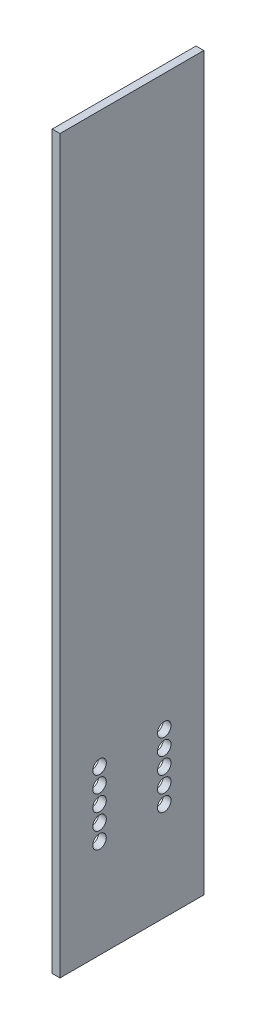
ISO-10303-21;
HEADER;
FILE_DESCRIPTION(('STEP AP214'),'2;1');
FILE_NAME('part.step','',(''),(''),'','','');
FILE_SCHEMA(('AUTOMOTIVE_DESIGN { 1 0 10303 214 1 1 1 1 }'));
ENDSEC;
DATA;
#1=APPLICATION_CONTEXT('core data for automotive mechanical design processes');
#2=APPLICATION_PROTOCOL_DEFINITION('international standard','automotive_design',2000,#1);
#3=PRODUCT_CONTEXT('',#1,'mechanical');
#4=PRODUCT('Part','Part','',(#3));
#5=PRODUCT_RELATED_PRODUCT_CATEGORY('part','',(#4));
#6=PRODUCT_DEFINITION_FORMATION('','',#4);
#7=PRODUCT_DEFINITION_CONTEXT('part definition',#1,'design');
#8=PRODUCT_DEFINITION('design','',#6,#7);
#9=PRODUCT_DEFINITION_SHAPE('','',#8);
#10=(LENGTH_UNIT() NAMED_UNIT(*) SI_UNIT(.MILLI.,.METRE.));
#11=(NAMED_UNIT(*) PLANE_ANGLE_UNIT() SI_UNIT($,.RADIAN.));
#12=(NAMED_UNIT(*) SI_UNIT($,.STERADIAN.) SOLID_ANGLE_UNIT());
#13=UNCERTAINTY_MEASURE_WITH_UNIT(LENGTH_MEASURE(1.E-05),#10,'distance_accuracy_value','');
#14=(GEOMETRIC_REPRESENTATION_CONTEXT(3) GLOBAL_UNCERTAINTY_ASSIGNED_CONTEXT((#13)) GLOBAL_UNIT_ASSIGNED_CONTEXT((#10,
#11,#12)) REPRESENTATION_CONTEXT('',''));
#15=CARTESIAN_POINT('',(0.,0.,0.));
#16=DIRECTION('',(0.,0.,1.));
#17=DIRECTION('',(1.,0.,0.));
#18=AXIS2_PLACEMENT_3D('',#15,#16,#17);
#19=CARTESIAN_POINT('',(3.048,143.51,-28.2194));
#20=DIRECTION('',(0.,0.,1.));
#21=DIRECTION('',(0.,-1.,0.));
#22=AXIS2_PLACEMENT_3D('',#19,#20,#21);
#23=PLANE('',#22);
#24=DIRECTION('',(0.,1.,0.));
#25=VECTOR('',#24,1.);
#26=CARTESIAN_POINT('',(0.,143.51,-28.2194));
#27=LINE('',#26,#25);
#28=CARTESIAN_POINT('',(0.,-143.51,-28.2194));
#29=VERTEX_POINT('',#28);
#30=CARTESIAN_POINT('',(0.,143.51,-28.2194));
#31=VERTEX_POINT('',#30);
#32=EDGE_CURVE('E107',#29,#31,#27,.T.);
#33=ORIENTED_EDGE('',*,*,#32,.T.);
#34=DIRECTION('',(-1.,0.,0.));
#35=VECTOR('',#34,1.);
#36=CARTESIAN_POINT('',(3.048,143.51,-28.2194));
#37=LINE('',#36,#35);
#38=CARTESIAN_POINT('',(3.048,143.51,-28.2194));
#39=VERTEX_POINT('',#38);
#40=EDGE_CURVE('E11',#39,#31,#37,.T.);
#41=ORIENTED_EDGE('',*,*,#40,.F.);
#42=DIRECTION('',(0.,1.,0.));
#43=VECTOR('',#42,1.);
#44=CARTESIAN_POINT('',(3.048,143.51,-28.2194));
#45=LINE('',#44,#43);
#46=CARTESIAN_POINT('',(3.048,-143.51,-28.2194));
#47=VERTEX_POINT('',#46);
#48=EDGE_CURVE('E91',#47,#39,#45,.T.);
#49=ORIENTED_EDGE('',*,*,#48,.F.);
#50=DIRECTION('',(-1.,0.,0.));
#51=VECTOR('',#50,1.);
#52=CARTESIAN_POINT('',(3.048,-143.51,-28.2194));
#53=LINE('',#52,#51);
#54=EDGE_CURVE('E103',#47,#29,#53,.T.);
#55=ORIENTED_EDGE('',*,*,#54,.T.);
#56=EDGE_LOOP('',(#33,#41,#49,#55));
#57=FACE_BOUND('',#56,.T.);
#58=ADVANCED_FACE('F39',(#57),#23,.F.);
#59=CARTESIAN_POINT('',(3.048,143.51,28.2194));
#60=DIRECTION('',(0.,-1.,0.));
#61=DIRECTION('',(0.,0.,-1.));
#62=AXIS2_PLACEMENT_3D('',#59,#60,#61);
#63=PLANE('',#62);
#64=DIRECTION('',(0.,0.,1.));
#65=VECTOR('',#64,1.);
#66=CARTESIAN_POINT('',(0.,143.51,28.2194));
#67=LINE('',#66,#65);
#68=CARTESIAN_POINT('',(0.,143.51,28.2194));
#69=VERTEX_POINT('',#68);
#70=EDGE_CURVE('E96',#31,#69,#67,.T.);
#71=ORIENTED_EDGE('',*,*,#70,.T.);
#72=DIRECTION('',(-1.,0.,0.));
#73=VECTOR('',#72,1.);
#74=CARTESIAN_POINT('',(3.048,143.51,28.2194));
#75=LINE('',#74,#73);
#76=CARTESIAN_POINT('',(3.048,143.51,28.2194));
#77=VERTEX_POINT('',#76);
#78=EDGE_CURVE('E48',#77,#69,#75,.T.);
#79=ORIENTED_EDGE('',*,*,#78,.F.);
#80=DIRECTION('',(0.,0.,1.));
#81=VECTOR('',#80,1.);
#82=CARTESIAN_POINT('',(3.048,143.51,28.2194));
#83=LINE('',#82,#81);
#84=EDGE_CURVE('E86',#39,#77,#83,.T.);
#85=ORIENTED_EDGE('',*,*,#84,.F.);
#86=ORIENTED_EDGE('',*,*,#40,.T.);
#87=EDGE_LOOP('',(#71,#79,#85,#86));
#88=FACE_BOUND('',#87,.T.);
#89=ADVANCED_FACE('F95',(#88),#63,.F.);
#90=CARTESIAN_POINT('',(3.048,143.51,28.2194));
#91=DIRECTION('',(0.,0.,-1.));
#92=DIRECTION('',(0.,1.,0.));
#93=AXIS2_PLACEMENT_3D('',#90,#91,#92);
#94=PLANE('',#93);
#95=DIRECTION('',(0.,-1.,0.));
#96=VECTOR('',#95,1.);
#97=CARTESIAN_POINT('',(0.,143.51,28.2194));
#98=LINE('',#97,#96);
#99=CARTESIAN_POINT('',(0.,-143.51,28.2194));
#100=VERTEX_POINT('',#99);
#101=EDGE_CURVE('E73',#69,#100,#98,.T.);
#102=ORIENTED_EDGE('',*,*,#101,.T.);
#103=DIRECTION('',(-1.,0.,0.));
#104=VECTOR('',#103,1.);
#105=CARTESIAN_POINT('',(3.048,-143.51,28.2194));
#106=LINE('',#105,#104);
#107=CARTESIAN_POINT('',(3.048,-143.51,28.2194));
#108=VERTEX_POINT('',#107);
#109=EDGE_CURVE('E98',#108,#100,#106,.T.);
#110=ORIENTED_EDGE('',*,*,#109,.F.);
#111=DIRECTION('',(0.,-1.,0.));
#112=VECTOR('',#111,1.);
#113=CARTESIAN_POINT('',(3.048,143.51,28.2194));
#114=LINE('',#113,#112);
#115=EDGE_CURVE('E89',#77,#108,#114,.T.);
#116=ORIENTED_EDGE('',*,*,#115,.F.);
#117=ORIENTED_EDGE('',*,*,#78,.T.);
#118=EDGE_LOOP('',(#102,#110,#116,#117));
#119=FACE_BOUND('',#118,.T.);
#120=ADVANCED_FACE('F99',(#119),#94,.F.);
#121=CARTESIAN_POINT('',(3.048,-143.51,28.2194));
#122=DIRECTION('',(0.,1.,0.));
#123=DIRECTION('',(0.,0.,1.));
#124=AXIS2_PLACEMENT_3D('',#121,#122,#123);
#125=PLANE('',#124);
#126=DIRECTION('',(0.,0.,-1.));
#127=VECTOR('',#126,1.);
#128=CARTESIAN_POINT('',(0.,-143.51,28.2194));
#129=LINE('',#128,#127);
#130=EDGE_CURVE('E79',#100,#29,#129,.T.);
#131=ORIENTED_EDGE('',*,*,#130,.T.);
#132=ORIENTED_EDGE('',*,*,#54,.F.);
#133=DIRECTION('',(0.,0.,-1.));
#134=VECTOR('',#133,1.);
#135=CARTESIAN_POINT('',(3.048,-143.51,28.2194));
#136=LINE('',#135,#134);
#137=EDGE_CURVE('E56',#108,#47,#136,.T.);
#138=ORIENTED_EDGE('',*,*,#137,.F.);
#139=ORIENTED_EDGE('',*,*,#109,.T.);
#140=EDGE_LOOP('',(#131,#132,#138,#139));
#141=FACE_BOUND('',#140,.T.);
#142=ADVANCED_FACE('F121',(#141),#125,.F.);
#143=CARTESIAN_POINT('',(3.048,0.,0.));
#144=DIRECTION('',(1.,0.,0.));
#145=DIRECTION('',(0.,0.,-1.));
#146=AXIS2_PLACEMENT_3D('',#143,#144,#145);
#147=PLANE('',#146);
#148=CARTESIAN_POINT('',(3.048,-79.4512,12.7));
#149=DIRECTION('',(1.,0.,0.));
#150=DIRECTION('',(0.,0.,-1.));
#151=AXIS2_PLACEMENT_3D('',#148,#149,#150);
#152=CIRCLE('',#151,2.6543);
#153=CARTESIAN_POINT('',(3.048,-79.4512,10.0457));
#154=VERTEX_POINT('',#153);
#155=EDGE_CURVE('E203',#154,#154,#152,.T.);
#156=ORIENTED_EDGE('',*,*,#155,.F.);
#157=EDGE_LOOP('',(#156));
#158=FACE_BOUND('',#157,.T.);
#159=CARTESIAN_POINT('',(3.048,-79.4512,-12.7));
#160=DIRECTION('',(1.,0.,0.));
#161=DIRECTION('',(0.,0.,-1.));
#162=AXIS2_PLACEMENT_3D('',#159,#160,#161);
#163=CIRCLE('',#162,2.6543);
#164=CARTESIAN_POINT('',(3.048,-79.4512,-15.3543));
#165=VERTEX_POINT('',#164);
#166=EDGE_CURVE('E195',#165,#165,#163,.T.);
#167=ORIENTED_EDGE('',*,*,#166,.F.);
#168=EDGE_LOOP('',(#167));
#169=FACE_BOUND('',#168,.T.);
#170=CARTESIAN_POINT('',(3.048,-85.8012,12.7));
#171=DIRECTION('',(1.,0.,0.));
#172=DIRECTION('',(0.,0.,-1.));
#173=AXIS2_PLACEMENT_3D('',#170,#171,#172);
#174=CIRCLE('',#173,2.6543);
#175=CARTESIAN_POINT('',(3.048,-85.8012,10.0457));
#176=VERTEX_POINT('',#175);
#177=EDGE_CURVE('E187',#176,#176,#174,.T.);
#178=ORIENTED_EDGE('',*,*,#177,.F.);
#179=EDGE_LOOP('',(#178));
#180=FACE_BOUND('',#179,.T.);
#181=CARTESIAN_POINT('',(3.048,-85.8012,-12.7));
#182=DIRECTION('',(1.,0.,0.));
#183=DIRECTION('',(0.,0.,-1.));
#184=AXIS2_PLACEMENT_3D('',#181,#182,#183);
#185=CIRCLE('',#184,2.6543);
#186=CARTESIAN_POINT('',(3.048,-85.8012,-15.3543));
#187=VERTEX_POINT('',#186);
#188=EDGE_CURVE('E179',#187,#187,#185,.T.);
#189=ORIENTED_EDGE('',*,*,#188,.F.);
#190=EDGE_LOOP('',(#189));
#191=FACE_BOUND('',#190,.T.);
#192=CARTESIAN_POINT('',(3.048,-92.1512,12.7));
#193=DIRECTION('',(1.,0.,0.));
#194=DIRECTION('',(0.,0.,-1.));
#195=AXIS2_PLACEMENT_3D('',#192,#193,#194);
#196=CIRCLE('',#195,2.6543);
#197=CARTESIAN_POINT('',(3.048,-92.1512,10.0457));
#198=VERTEX_POINT('',#197);
#199=EDGE_CURVE('E171',#198,#198,#196,.T.);
#200=ORIENTED_EDGE('',*,*,#199,.F.);
#201=EDGE_LOOP('',(#200));
#202=FACE_BOUND('',#201,.T.);
#203=CARTESIAN_POINT('',(3.048,-92.1512,-12.7));
#204=DIRECTION('',(1.,0.,0.));
#205=DIRECTION('',(0.,0.,-1.));
#206=AXIS2_PLACEMENT_3D('',#203,#204,#205);
#207=CIRCLE('',#206,2.6543);
#208=CARTESIAN_POINT('',(3.048,-92.1512,-15.3543));
#209=VERTEX_POINT('',#208);
#210=EDGE_CURVE('E163',#209,#209,#207,.T.);
#211=ORIENTED_EDGE('',*,*,#210,.F.);
#212=EDGE_LOOP('',(#211));
#213=FACE_BOUND('',#212,.T.);
#214=CARTESIAN_POINT('',(3.048,-104.8512,12.7));
#215=DIRECTION('',(1.,0.,0.));
#216=DIRECTION('',(0.,0.,-1.));
#217=AXIS2_PLACEMENT_3D('',#214,#215,#216);
#218=CIRCLE('',#217,2.6543);
#219=CARTESIAN_POINT('',(3.048,-104.8512,10.0457));
#220=VERTEX_POINT('',#219);
#221=EDGE_CURVE('E155',#220,#220,#218,.T.);
#222=ORIENTED_EDGE('',*,*,#221,.F.);
#223=EDGE_LOOP('',(#222));
#224=FACE_BOUND('',#223,.T.);
#225=CARTESIAN_POINT('',(3.048,-104.8512,-12.7));
#226=DIRECTION('',(1.,0.,0.));
#227=DIRECTION('',(0.,0.,-1.));
#228=AXIS2_PLACEMENT_3D('',#225,#226,#227);
#229=CIRCLE('',#228,2.6543);
#230=CARTESIAN_POINT('',(3.048,-104.8512,-15.3543));
#231=VERTEX_POINT('',#230);
#232=EDGE_CURVE('E147',#231,#231,#229,.T.);
#233=ORIENTED_EDGE('',*,*,#232,.F.);
#234=EDGE_LOOP('',(#233));
#235=FACE_BOUND('',#234,.T.);
#236=CARTESIAN_POINT('',(3.048,-98.5012,12.7));
#237=DIRECTION('',(1.,0.,0.));
#238=DIRECTION('',(0.,0.,-1.));
#239=AXIS2_PLACEMENT_3D('',#236,#237,#238);
#240=CIRCLE('',#239,2.6543);
#241=CARTESIAN_POINT('',(3.048,-98.5012,10.0457));
#242=VERTEX_POINT('',#241);
#243=EDGE_CURVE('E139',#242,#242,#240,.T.);
#244=ORIENTED_EDGE('',*,*,#243,.F.);
#245=EDGE_LOOP('',(#244));
#246=FACE_BOUND('',#245,.T.);
#247=CARTESIAN_POINT('',(3.048,-98.5012,-12.7));
#248=DIRECTION('',(1.,0.,0.));
#249=DIRECTION('',(0.,0.,-1.));
#250=AXIS2_PLACEMENT_3D('',#247,#248,#249);
#251=CIRCLE('',#250,2.6543);
#252=CARTESIAN_POINT('',(3.048,-98.5012,-15.3543));
#253=VERTEX_POINT('',#252);
#254=EDGE_CURVE('E131',#253,#253,#251,.T.);
#255=ORIENTED_EDGE('',*,*,#254,.F.);
#256=EDGE_LOOP('',(#255));
#257=FACE_BOUND('',#256,.T.);
#258=ORIENTED_EDGE('',*,*,#48,.T.);
#259=ORIENTED_EDGE('',*,*,#84,.T.);
#260=ORIENTED_EDGE('',*,*,#115,.T.);
#261=ORIENTED_EDGE('',*,*,#137,.T.);
#262=EDGE_LOOP('',(#258,#259,#260,#261));
#263=FACE_BOUND('',#262,.T.);
#264=ADVANCED_FACE('F87',(#158,#169,#180,#191,#202,#213,#224,#235,#246,#257,#263),#147,.T.);
#265=CARTESIAN_POINT('',(0.,0.,0.));
#266=DIRECTION('',(1.,0.,0.));
#267=DIRECTION('',(0.,0.,-1.));
#268=AXIS2_PLACEMENT_3D('',#265,#266,#267);
#269=PLANE('',#268);
#270=CARTESIAN_POINT('',(0.,-79.4512,12.7));
#271=DIRECTION('',(1.,0.,0.));
#272=DIRECTION('',(0.,0.,-1.));
#273=AXIS2_PLACEMENT_3D('',#270,#271,#272);
#274=CIRCLE('',#273,2.6543);
#275=CARTESIAN_POINT('',(0.,-79.4512,10.0457));
#276=VERTEX_POINT('',#275);
#277=EDGE_CURVE('E199',#276,#276,#274,.T.);
#278=ORIENTED_EDGE('',*,*,#277,.T.);
#279=EDGE_LOOP('',(#278));
#280=FACE_BOUND('',#279,.T.);
#281=CARTESIAN_POINT('',(0.,-79.4512,-12.7));
#282=DIRECTION('',(1.,0.,0.));
#283=DIRECTION('',(0.,0.,-1.));
#284=AXIS2_PLACEMENT_3D('',#281,#282,#283);
#285=CIRCLE('',#284,2.6543);
#286=CARTESIAN_POINT('',(0.,-79.4512,-15.3543));
#287=VERTEX_POINT('',#286);
#288=EDGE_CURVE('E191',#287,#287,#285,.T.);
#289=ORIENTED_EDGE('',*,*,#288,.T.);
#290=EDGE_LOOP('',(#289));
#291=FACE_BOUND('',#290,.T.);
#292=CARTESIAN_POINT('',(0.,-85.8012,12.7));
#293=DIRECTION('',(1.,0.,0.));
#294=DIRECTION('',(0.,0.,-1.));
#295=AXIS2_PLACEMENT_3D('',#292,#293,#294);
#296=CIRCLE('',#295,2.6543);
#297=CARTESIAN_POINT('',(0.,-85.8012,10.0457));
#298=VERTEX_POINT('',#297);
#299=EDGE_CURVE('E183',#298,#298,#296,.T.);
#300=ORIENTED_EDGE('',*,*,#299,.T.);
#301=EDGE_LOOP('',(#300));
#302=FACE_BOUND('',#301,.T.);
#303=CARTESIAN_POINT('',(0.,-85.8012,-12.7));
#304=DIRECTION('',(1.,0.,0.));
#305=DIRECTION('',(0.,0.,-1.));
#306=AXIS2_PLACEMENT_3D('',#303,#304,#305);
#307=CIRCLE('',#306,2.6543);
#308=CARTESIAN_POINT('',(0.,-85.8012,-15.3543));
#309=VERTEX_POINT('',#308);
#310=EDGE_CURVE('E175',#309,#309,#307,.T.);
#311=ORIENTED_EDGE('',*,*,#310,.T.);
#312=EDGE_LOOP('',(#311));
#313=FACE_BOUND('',#312,.T.);
#314=CARTESIAN_POINT('',(0.,-92.1512,12.7));
#315=DIRECTION('',(1.,0.,0.));
#316=DIRECTION('',(0.,0.,-1.));
#317=AXIS2_PLACEMENT_3D('',#314,#315,#316);
#318=CIRCLE('',#317,2.6543);
#319=CARTESIAN_POINT('',(0.,-92.1512,10.0457));
#320=VERTEX_POINT('',#319);
#321=EDGE_CURVE('E167',#320,#320,#318,.T.);
#322=ORIENTED_EDGE('',*,*,#321,.T.);
#323=EDGE_LOOP('',(#322));
#324=FACE_BOUND('',#323,.T.);
#325=CARTESIAN_POINT('',(0.,-92.1512,-12.7));
#326=DIRECTION('',(1.,0.,0.));
#327=DIRECTION('',(0.,0.,-1.));
#328=AXIS2_PLACEMENT_3D('',#325,#326,#327);
#329=CIRCLE('',#328,2.6543);
#330=CARTESIAN_POINT('',(0.,-92.1512,-15.3543));
#331=VERTEX_POINT('',#330);
#332=EDGE_CURVE('E159',#331,#331,#329,.T.);
#333=ORIENTED_EDGE('',*,*,#332,.T.);
#334=EDGE_LOOP('',(#333));
#335=FACE_BOUND('',#334,.T.);
#336=CARTESIAN_POINT('',(0.,-104.8512,12.7));
#337=DIRECTION('',(1.,0.,0.));
#338=DIRECTION('',(0.,0.,-1.));
#339=AXIS2_PLACEMENT_3D('',#336,#337,#338);
#340=CIRCLE('',#339,2.6543);
#341=CARTESIAN_POINT('',(0.,-104.8512,10.0457));
#342=VERTEX_POINT('',#341);
#343=EDGE_CURVE('E151',#342,#342,#340,.T.);
#344=ORIENTED_EDGE('',*,*,#343,.T.);
#345=EDGE_LOOP('',(#344));
#346=FACE_BOUND('',#345,.T.);
#347=CARTESIAN_POINT('',(0.,-104.8512,-12.7));
#348=DIRECTION('',(1.,0.,0.));
#349=DIRECTION('',(0.,0.,-1.));
#350=AXIS2_PLACEMENT_3D('',#347,#348,#349);
#351=CIRCLE('',#350,2.6543);
#352=CARTESIAN_POINT('',(0.,-104.8512,-15.3543));
#353=VERTEX_POINT('',#352);
#354=EDGE_CURVE('E143',#353,#353,#351,.T.);
#355=ORIENTED_EDGE('',*,*,#354,.T.);
#356=EDGE_LOOP('',(#355));
#357=FACE_BOUND('',#356,.T.);
#358=CARTESIAN_POINT('',(0.,-98.5012,12.7));
#359=DIRECTION('',(1.,0.,0.));
#360=DIRECTION('',(0.,0.,-1.));
#361=AXIS2_PLACEMENT_3D('',#358,#359,#360);
#362=CIRCLE('',#361,2.6543);
#363=CARTESIAN_POINT('',(0.,-98.5012,10.0457));
#364=VERTEX_POINT('',#363);
#365=EDGE_CURVE('E135',#364,#364,#362,.T.);
#366=ORIENTED_EDGE('',*,*,#365,.T.);
#367=EDGE_LOOP('',(#366));
#368=FACE_BOUND('',#367,.T.);
#369=CARTESIAN_POINT('',(0.,-98.5012,-12.7));
#370=DIRECTION('',(1.,0.,0.));
#371=DIRECTION('',(0.,0.,-1.));
#372=AXIS2_PLACEMENT_3D('',#369,#370,#371);
#373=CIRCLE('',#372,2.6543);
#374=CARTESIAN_POINT('',(0.,-98.5012,-15.3543));
#375=VERTEX_POINT('',#374);
#376=EDGE_CURVE('E111',#375,#375,#373,.T.);
#377=ORIENTED_EDGE('',*,*,#376,.T.);
#378=EDGE_LOOP('',(#377));
#379=FACE_BOUND('',#378,.T.);
#380=ORIENTED_EDGE('',*,*,#32,.F.);
#381=ORIENTED_EDGE('',*,*,#130,.F.);
#382=ORIENTED_EDGE('',*,*,#101,.F.);
#383=ORIENTED_EDGE('',*,*,#70,.F.);
#384=EDGE_LOOP('',(#380,#381,#382,#383));
#385=FACE_BOUND('',#384,.T.);
#386=ADVANCED_FACE('F124',(#280,#291,#302,#313,#324,#335,#346,#357,#368,#379,#385),#269,.F.);
#387=CARTESIAN_POINT('',(3.048,-98.5012,-12.7));
#388=DIRECTION('',(1.,0.,0.));
#389=DIRECTION('',(0.,0.,-1.));
#390=AXIS2_PLACEMENT_3D('',#387,#388,#389);
#391=CYLINDRICAL_SURFACE('',#390,2.6543);
#392=ORIENTED_EDGE('',*,*,#376,.F.);
#393=EDGE_LOOP('',(#392));
#394=FACE_BOUND('',#393,.T.);
#395=ORIENTED_EDGE('',*,*,#254,.T.);
#396=EDGE_LOOP('',(#395));
#397=FACE_BOUND('',#396,.T.);
#398=ADVANCED_FACE('F231',(#394,#397),#391,.F.);
#399=CARTESIAN_POINT('',(3.048,-98.5012,12.7));
#400=DIRECTION('',(1.,0.,0.));
#401=DIRECTION('',(0.,0.,-1.));
#402=AXIS2_PLACEMENT_3D('',#399,#400,#401);
#403=CYLINDRICAL_SURFACE('',#402,2.6543);
#404=ORIENTED_EDGE('',*,*,#365,.F.);
#405=EDGE_LOOP('',(#404));
#406=FACE_BOUND('',#405,.T.);
#407=ORIENTED_EDGE('',*,*,#243,.T.);
#408=EDGE_LOOP('',(#407));
#409=FACE_BOUND('',#408,.T.);
#410=ADVANCED_FACE('F233',(#406,#409),#403,.F.);
#411=CARTESIAN_POINT('',(3.048,-104.8512,-12.7));
#412=DIRECTION('',(1.,0.,0.));
#413=DIRECTION('',(0.,0.,-1.));
#414=AXIS2_PLACEMENT_3D('',#411,#412,#413);
#415=CYLINDRICAL_SURFACE('',#414,2.6543);
#416=ORIENTED_EDGE('',*,*,#354,.F.);
#417=EDGE_LOOP('',(#416));
#418=FACE_BOUND('',#417,.T.);
#419=ORIENTED_EDGE('',*,*,#232,.T.);
#420=EDGE_LOOP('',(#419));
#421=FACE_BOUND('',#420,.T.);
#422=ADVANCED_FACE('F240',(#418,#421),#415,.F.);
#423=CARTESIAN_POINT('',(3.048,-104.8512,12.7));
#424=DIRECTION('',(1.,0.,0.));
#425=DIRECTION('',(0.,0.,-1.));
#426=AXIS2_PLACEMENT_3D('',#423,#424,#425);
#427=CYLINDRICAL_SURFACE('',#426,2.6543);
#428=ORIENTED_EDGE('',*,*,#343,.F.);
#429=EDGE_LOOP('',(#428));
#430=FACE_BOUND('',#429,.T.);
#431=ORIENTED_EDGE('',*,*,#221,.T.);
#432=EDGE_LOOP('',(#431));
#433=FACE_BOUND('',#432,.T.);
#434=ADVANCED_FACE('F279',(#430,#433),#427,.F.);
#435=CARTESIAN_POINT('',(3.048,-92.1512,-12.7));
#436=DIRECTION('',(1.,0.,0.));
#437=DIRECTION('',(0.,0.,-1.));
#438=AXIS2_PLACEMENT_3D('',#435,#436,#437);
#439=CYLINDRICAL_SURFACE('',#438,2.6543);
#440=ORIENTED_EDGE('',*,*,#332,.F.);
#441=EDGE_LOOP('',(#440));
#442=FACE_BOUND('',#441,.T.);
#443=ORIENTED_EDGE('',*,*,#210,.T.);
#444=EDGE_LOOP('',(#443));
#445=FACE_BOUND('',#444,.T.);
#446=ADVANCED_FACE('F290',(#442,#445),#439,.F.);
#447=CARTESIAN_POINT('',(3.048,-92.1512,12.7));
#448=DIRECTION('',(1.,0.,0.));
#449=DIRECTION('',(0.,0.,-1.));
#450=AXIS2_PLACEMENT_3D('',#447,#448,#449);
#451=CYLINDRICAL_SURFACE('',#450,2.6543);
#452=ORIENTED_EDGE('',*,*,#321,.F.);
#453=EDGE_LOOP('',(#452));
#454=FACE_BOUND('',#453,.T.);
#455=ORIENTED_EDGE('',*,*,#199,.T.);
#456=EDGE_LOOP('',(#455));
#457=FACE_BOUND('',#456,.T.);
#458=ADVANCED_FACE('F300',(#454,#457),#451,.F.);
#459=CARTESIAN_POINT('',(3.048,-85.8012,-12.7));
#460=DIRECTION('',(1.,0.,0.));
#461=DIRECTION('',(0.,0.,-1.));
#462=AXIS2_PLACEMENT_3D('',#459,#460,#461);
#463=CYLINDRICAL_SURFACE('',#462,2.6543);
#464=ORIENTED_EDGE('',*,*,#310,.F.);
#465=EDGE_LOOP('',(#464));
#466=FACE_BOUND('',#465,.T.);
#467=ORIENTED_EDGE('',*,*,#188,.T.);
#468=EDGE_LOOP('',(#467));
#469=FACE_BOUND('',#468,.T.);
#470=ADVANCED_FACE('F310',(#466,#469),#463,.F.);
#471=CARTESIAN_POINT('',(3.048,-85.8012,12.7));
#472=DIRECTION('',(1.,0.,0.));
#473=DIRECTION('',(0.,0.,-1.));
#474=AXIS2_PLACEMENT_3D('',#471,#472,#473);
#475=CYLINDRICAL_SURFACE('',#474,2.6543);
#476=ORIENTED_EDGE('',*,*,#299,.F.);
#477=EDGE_LOOP('',(#476));
#478=FACE_BOUND('',#477,.T.);
#479=ORIENTED_EDGE('',*,*,#177,.T.);
#480=EDGE_LOOP('',(#479));
#481=FACE_BOUND('',#480,.T.);
#482=ADVANCED_FACE('F320',(#478,#481),#475,.F.);
#483=CARTESIAN_POINT('',(3.048,-79.4512,-12.7));
#484=DIRECTION('',(1.,0.,0.));
#485=DIRECTION('',(0.,0.,-1.));
#486=AXIS2_PLACEMENT_3D('',#483,#484,#485);
#487=CYLINDRICAL_SURFACE('',#486,2.6543);
#488=ORIENTED_EDGE('',*,*,#288,.F.);
#489=EDGE_LOOP('',(#488));
#490=FACE_BOUND('',#489,.T.);
#491=ORIENTED_EDGE('',*,*,#166,.T.);
#492=EDGE_LOOP('',(#491));
#493=FACE_BOUND('',#492,.T.);
#494=ADVANCED_FACE('F330',(#490,#493),#487,.F.);
#495=CARTESIAN_POINT('',(3.048,-79.4512,12.7));
#496=DIRECTION('',(1.,0.,0.));
#497=DIRECTION('',(0.,0.,-1.));
#498=AXIS2_PLACEMENT_3D('',#495,#496,#497);
#499=CYLINDRICAL_SURFACE('',#498,2.6543);
#500=ORIENTED_EDGE('',*,*,#277,.F.);
#501=EDGE_LOOP('',(#500));
#502=FACE_BOUND('',#501,.T.);
#503=ORIENTED_EDGE('',*,*,#155,.T.);
#504=EDGE_LOOP('',(#503));
#505=FACE_BOUND('',#504,.T.);
#506=ADVANCED_FACE('F208',(#502,#505),#499,.F.);
#507=CLOSED_SHELL('',(#58,#89,#120,#142,#264,#386,#398,#410,#422,#434,#446,#458,#470,#482,#494,#506));
#508=MANIFOLD_SOLID_BREP('B2',#507);
#509=ADVANCED_BREP_SHAPE_REPRESENTATION('',(#18,#508),#14);
#510=SHAPE_DEFINITION_REPRESENTATION(#9,#509);
ENDSEC;
END-ISO-10303-21;
